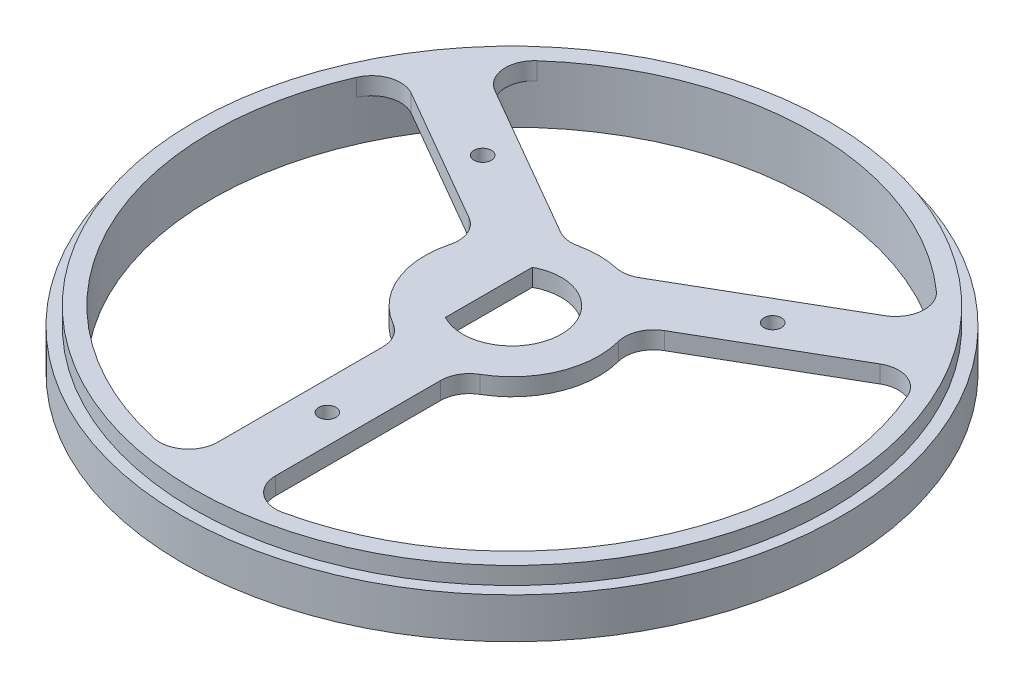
from build123d import *

# Parameters (mm, degrees)
SKETCH1_R           = 56.84006118
SKETCH1_R_2         = 51.85
BOSS_EXTRUDE1_DEPTH = 7
SKETCH2_R           = 54.85
SKETCH2_R_2         = 51.85
BOSS_EXTRUDE2_DEPTH = 3
BOSS_EXTRUDE3_START = -3
SKETCH3_R           = 1.5
BOSS_EXTRUDE3_DEPTH = 3
FILLET1_R           = 5
FILLET2_R           = 5


with BuildPart() as part:
    # Sketch1 → Boss-Extrude1 (new body)
    with BuildSketch(Plane(origin=(0, 0, 0), x_dir=(1, 0, 0), z_dir=(0, 1, 0))):
        with Locations(Location((0, 0, 0), (0, 0, 270))):
            Circle(SKETCH1_R)
        with Locations(Location((0, 0, 0), (0, 0, 270))):
            Circle(SKETCH1_R_2, mode=Mode.SUBTRACT)
    extrude(amount=BOSS_EXTRUDE1_DEPTH)

    # Sketch2 → Boss-Extrude2 (add)
    with BuildSketch(Plane(origin=(0, 7, 0), x_dir=(1, 0, 0), z_dir=(0, 1, 0))):
        with Locations(Location((0, 0, 0), (0, 0, 270))):
            Circle(SKETCH2_R)
        with Locations(Location((0, 0, 0), (0, 0, 270))):
            Circle(SKETCH2_R_2, mode=Mode.SUBTRACT)
    extrude(amount=BOSS_EXTRUDE2_DEPTH)

    # Sketch3 → Boss-Extrude3 (add)
    with BuildSketch(Plane(origin=(0, 10, 0), x_dir=(1, 0, 0), z_dir=(0, 1, 0)).offset(BOSS_EXTRUDE3_START)):
        with BuildLine():
            Line((-5, -14.142135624), (-5, -51.608356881))
            ThreePointArc((-5, -51.608356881), (0, -51.85), (5, -51.608356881))
            Line((5, -51.608356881), (5, -14.142135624))
            ThreePointArc((5, -14.142135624), (14.02732958, -5.313569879), (13.114815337, 7.280221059))
            Line((13.114815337, 7.280221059), (45.029160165, 25.705976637))
            ThreePointArc((45.029160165, 25.705976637), (42.328074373, 29.945894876), (39.229079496, 33.904303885))
            Line((39.229079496, 33.904303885), (5, 14.142135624))
            ThreePointArc((5, 14.142135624), (0, 15), (-5, 14.142135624))
            Line((-5, 14.142135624), (-39.229079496, 33.904303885))
            ThreePointArc((-39.229079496, 33.904303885), (-42.328074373, 29.945894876), (-45.029160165, 25.705976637))
            Line((-45.029160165, 25.705976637), (-13.114815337, 7.280221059))
            ThreePointArc((-13.114815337, 7.280221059), (-14.02732958, -5.313569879), (-5, -14.142135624))
        make_face()
        with Locations(Location((-25.007566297, 19.945894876, 0), (0, 0, 270))):
            Circle(SKETCH3_R, mode=Mode.SUBTRACT)
        with Locations(Location((25.007566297, 19.945894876, 0), (0, 0, 270))):
            Circle(SKETCH3_R, mode=Mode.SUBTRACT)
        with Locations(Location((0, -31.85, 0), (0, 0, 270))):
            Circle(SKETCH3_R, mode=Mode.SUBTRACT)
        with BuildLine():
            Line((-4, 0), (-4, 7.5))
            ThreePointArc((-4, 7.5), (8.5, 0), (-4, -7.5))
            Line((-4, -7.5), (-4, 0))
        make_face(mode=Mode.SUBTRACT)
    extrude(amount=BOSS_EXTRUDE3_DEPTH)

    # Fillet1
    fillet1_edges = [part.edges().sort_by_distance(p)[0] for p in [
        (45.029160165, 8.5, -25.705976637),
        (13.114815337, 8.5, -7.280221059),
        (5, 8.5, 14.142135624),
        (5, 8.5, 51.608356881),
    ]]
    fillet(fillet1_edges, radius=FILLET1_R)

    # Fillet2
    fillet2_edges = [part.edges().sort_by_distance(p)[0] for p in [
        (-5, 8.5, 14.142135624),
        (-13.114815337, 8.5, -7.280221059),
        (-45.029160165, 8.5, -25.705976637),
        (-39.229079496, 8.5, -33.904303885),
        (-5, 8.5, -14.142135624),
        (5, 8.5, -14.142135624),
        (39.229079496, 8.5, -33.904303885),
        (-5, 8.5, 51.608356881),
    ]]
    fillet(fillet2_edges, radius=FILLET2_R)


solid = part.part
